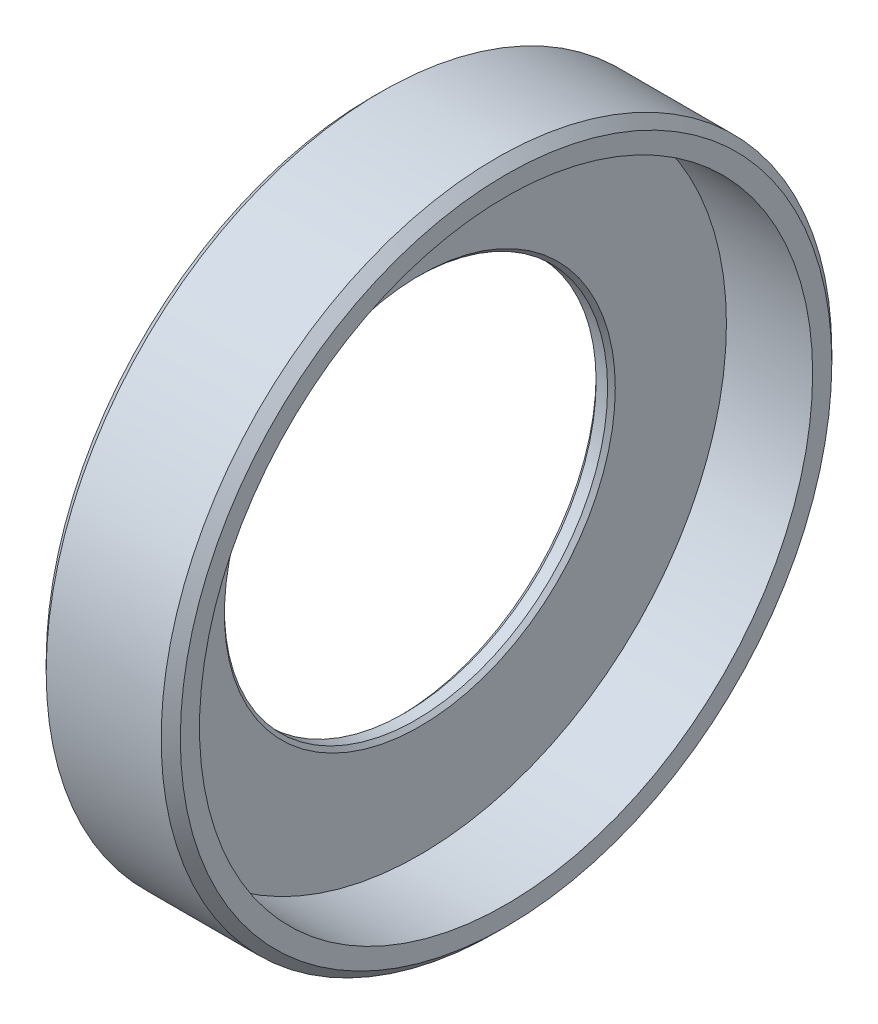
ISO-10303-21;
HEADER;
FILE_DESCRIPTION(('STEP AP214'),'2;1');
FILE_NAME('part.step','',(''),(''),'','','');
FILE_SCHEMA(('AUTOMOTIVE_DESIGN { 1 0 10303 214 1 1 1 1 }'));
ENDSEC;
DATA;
#1=APPLICATION_CONTEXT('core data for automotive mechanical design processes');
#2=APPLICATION_PROTOCOL_DEFINITION('international standard','automotive_design',2000,#1);
#3=PRODUCT_CONTEXT('',#1,'mechanical');
#4=PRODUCT('Part','Part','',(#3));
#5=PRODUCT_RELATED_PRODUCT_CATEGORY('part','',(#4));
#6=PRODUCT_DEFINITION_FORMATION('','',#4);
#7=PRODUCT_DEFINITION_CONTEXT('part definition',#1,'design');
#8=PRODUCT_DEFINITION('design','',#6,#7);
#9=PRODUCT_DEFINITION_SHAPE('','',#8);
#10=(LENGTH_UNIT() NAMED_UNIT(*) SI_UNIT(.MILLI.,.METRE.));
#11=(NAMED_UNIT(*) PLANE_ANGLE_UNIT() SI_UNIT($,.RADIAN.));
#12=(NAMED_UNIT(*) SI_UNIT($,.STERADIAN.) SOLID_ANGLE_UNIT());
#13=UNCERTAINTY_MEASURE_WITH_UNIT(LENGTH_MEASURE(1.E-05),#10,'distance_accuracy_value','');
#14=(GEOMETRIC_REPRESENTATION_CONTEXT(3) GLOBAL_UNCERTAINTY_ASSIGNED_CONTEXT((#13)) GLOBAL_UNIT_ASSIGNED_CONTEXT((#10,
#11,#12)) REPRESENTATION_CONTEXT('',''));
#15=CARTESIAN_POINT('',(0.,0.,0.));
#16=DIRECTION('',(0.,0.,1.));
#17=DIRECTION('',(1.,0.,0.));
#18=AXIS2_PLACEMENT_3D('',#15,#16,#17);
#19=CARTESIAN_POINT('',(0.,0.,0.));
#20=DIRECTION('',(1.,0.,0.));
#21=DIRECTION('',(0.,0.,-1.));
#22=AXIS2_PLACEMENT_3D('',#19,#20,#21);
#23=CYLINDRICAL_SURFACE('',#22,17.5);
#24=CARTESIAN_POINT('',(0.499999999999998,0.,0.));
#25=DIRECTION('',(-1.,0.,0.));
#26=DIRECTION('',(0.,0.,1.));
#27=AXIS2_PLACEMENT_3D('',#24,#25,#26);
#28=CIRCLE('',#27,17.5);
#29=CARTESIAN_POINT('',(0.499999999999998,0.,17.5));
#30=VERTEX_POINT('',#29);
#31=EDGE_CURVE('E68',#30,#30,#28,.F.);
#32=ORIENTED_EDGE('',*,*,#31,.T.);
#33=EDGE_LOOP('',(#32));
#34=FACE_BOUND('',#33,.T.);
#35=CARTESIAN_POINT('',(6.5,0.,0.));
#36=DIRECTION('',(1.,0.,0.));
#37=DIRECTION('',(0.,0.,-1.));
#38=AXIS2_PLACEMENT_3D('',#35,#36,#37);
#39=CIRCLE('',#38,17.5);
#40=CARTESIAN_POINT('',(6.5,0.,-17.5));
#41=VERTEX_POINT('',#40);
#42=EDGE_CURVE('E72',#41,#41,#39,.F.);
#43=ORIENTED_EDGE('',*,*,#42,.T.);
#44=EDGE_LOOP('',(#43));
#45=FACE_BOUND('',#44,.T.);
#46=ADVANCED_FACE('F35',(#34,#45),#23,.T.);
#47=CARTESIAN_POINT('',(0.,0.,-17.5));
#48=DIRECTION('',(-1.,0.,0.));
#49=DIRECTION('',(0.,0.,1.));
#50=AXIS2_PLACEMENT_3D('',#47,#48,#49);
#51=PLANE('',#50);
#52=CARTESIAN_POINT('',(0.,0.,0.));
#53=DIRECTION('',(-1.,0.,0.));
#54=DIRECTION('',(0.,0.,1.));
#55=AXIS2_PLACEMENT_3D('',#52,#53,#54);
#56=CIRCLE('',#55,17.);
#57=CARTESIAN_POINT('',(0.,0.,17.));
#58=VERTEX_POINT('',#57);
#59=EDGE_CURVE('E64',#58,#58,#56,.T.);
#60=ORIENTED_EDGE('',*,*,#59,.T.);
#61=EDGE_LOOP('',(#60));
#62=FACE_BOUND('',#61,.T.);
#63=CARTESIAN_POINT('',(0.,0.,0.));
#64=DIRECTION('',(1.,0.,0.));
#65=DIRECTION('',(0.,0.,-1.));
#66=AXIS2_PLACEMENT_3D('',#63,#64,#65);
#67=CIRCLE('',#66,15.);
#68=CARTESIAN_POINT('',(0.,0.,-15.));
#69=VERTEX_POINT('',#68);
#70=EDGE_CURVE('E76',#69,#69,#67,.T.);
#71=ORIENTED_EDGE('',*,*,#70,.T.);
#72=EDGE_LOOP('',(#71));
#73=FACE_BOUND('',#72,.T.);
#74=ADVANCED_FACE('F106',(#62,#73),#51,.T.);
#75=CARTESIAN_POINT('',(0.,0.,0.));
#76=DIRECTION('',(-1.,0.,0.));
#77=DIRECTION('',(0.,0.,1.));
#78=AXIS2_PLACEMENT_3D('',#75,#76,#77);
#79=CONICAL_SURFACE('',#78,15.,1.27933953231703);
#80=CARTESIAN_POINT('',(1.41428571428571,0.,0.));
#81=DIRECTION('',(1.,0.,0.));
#82=DIRECTION('',(0.,0.,-1.));
#83=AXIS2_PLACEMENT_3D('',#80,#81,#82);
#84=CIRCLE('',#83,10.2857142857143);
#85=CARTESIAN_POINT('',(1.41428571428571,0.,-10.2857142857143));
#86=VERTEX_POINT('',#85);
#87=EDGE_CURVE('E54',#86,#86,#84,.T.);
#88=ORIENTED_EDGE('',*,*,#87,.T.);
#89=EDGE_LOOP('',(#88));
#90=FACE_BOUND('',#89,.T.);
#91=ORIENTED_EDGE('',*,*,#70,.F.);
#92=EDGE_LOOP('',(#91));
#93=FACE_BOUND('',#92,.T.);
#94=ADVANCED_FACE('F112',(#90,#93),#79,.F.);
#95=CARTESIAN_POINT('',(0.,0.,0.));
#96=DIRECTION('',(1.,0.,0.));
#97=DIRECTION('',(0.,0.,-1.));
#98=AXIS2_PLACEMENT_3D('',#95,#96,#97);
#99=CYLINDRICAL_SURFACE('',#98,10.);
#100=CARTESIAN_POINT('',(1.7,0.,0.));
#101=DIRECTION('',(-1.,0.,0.));
#102=DIRECTION('',(0.,0.,1.));
#103=AXIS2_PLACEMENT_3D('',#100,#101,#102);
#104=CIRCLE('',#103,10.);
#105=CARTESIAN_POINT('',(1.7,0.,10.));
#106=VERTEX_POINT('',#105);
#107=EDGE_CURVE('E43',#106,#106,#104,.T.);
#108=ORIENTED_EDGE('',*,*,#107,.T.);
#109=EDGE_LOOP('',(#108));
#110=FACE_BOUND('',#109,.T.);
#111=CARTESIAN_POINT('',(2.30000000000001,0.,0.));
#112=DIRECTION('',(1.,0.,0.));
#113=DIRECTION('',(0.,0.,-1.));
#114=AXIS2_PLACEMENT_3D('',#111,#112,#113);
#115=CIRCLE('',#114,10.);
#116=CARTESIAN_POINT('',(2.30000000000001,0.,-10.));
#117=VERTEX_POINT('',#116);
#118=EDGE_CURVE('E49',#117,#117,#115,.T.);
#119=ORIENTED_EDGE('',*,*,#118,.T.);
#120=EDGE_LOOP('',(#119));
#121=FACE_BOUND('',#120,.T.);
#122=ADVANCED_FACE('F132',(#110,#121),#99,.F.);
#123=CARTESIAN_POINT('',(2.5,0.,-10.));
#124=DIRECTION('',(1.,0.,0.));
#125=DIRECTION('',(0.,0.,-1.));
#126=AXIS2_PLACEMENT_3D('',#123,#124,#125);
#127=PLANE('',#126);
#128=CARTESIAN_POINT('',(2.5,0.,0.));
#129=DIRECTION('',(1.,0.,0.));
#130=DIRECTION('',(0.,0.,-1.));
#131=AXIS2_PLACEMENT_3D('',#128,#129,#130);
#132=CIRCLE('',#131,10.2);
#133=CARTESIAN_POINT('',(2.5,0.,-10.2));
#134=VERTEX_POINT('',#133);
#135=EDGE_CURVE('E10',#134,#134,#132,.F.);
#136=ORIENTED_EDGE('',*,*,#135,.T.);
#137=EDGE_LOOP('',(#136));
#138=FACE_BOUND('',#137,.T.);
#139=CARTESIAN_POINT('',(2.5,0.,0.));
#140=DIRECTION('',(1.,0.,0.));
#141=DIRECTION('',(0.,0.,-1.));
#142=AXIS2_PLACEMENT_3D('',#139,#140,#141);
#143=CIRCLE('',#142,16.);
#144=CARTESIAN_POINT('',(2.5,0.,-16.));
#145=VERTEX_POINT('',#144);
#146=EDGE_CURVE('E80',#145,#145,#143,.T.);
#147=ORIENTED_EDGE('',*,*,#146,.T.);
#148=EDGE_LOOP('',(#147));
#149=FACE_BOUND('',#148,.T.);
#150=ADVANCED_FACE('F103',(#138,#149),#127,.T.);
#151=CARTESIAN_POINT('',(0.,0.,0.));
#152=DIRECTION('',(1.,0.,0.));
#153=DIRECTION('',(0.,0.,-1.));
#154=AXIS2_PLACEMENT_3D('',#151,#152,#153);
#155=CYLINDRICAL_SURFACE('',#154,16.);
#156=CARTESIAN_POINT('',(7.,0.,0.));
#157=DIRECTION('',(1.,0.,0.));
#158=DIRECTION('',(0.,0.,-1.));
#159=AXIS2_PLACEMENT_3D('',#156,#157,#158);
#160=CIRCLE('',#159,16.);
#161=CARTESIAN_POINT('',(7.,0.,-16.));
#162=VERTEX_POINT('',#161);
#163=EDGE_CURVE('E83',#162,#162,#160,.T.);
#164=ORIENTED_EDGE('',*,*,#163,.T.);
#165=EDGE_LOOP('',(#164));
#166=FACE_BOUND('',#165,.T.);
#167=ORIENTED_EDGE('',*,*,#146,.F.);
#168=EDGE_LOOP('',(#167));
#169=FACE_BOUND('',#168,.T.);
#170=ADVANCED_FACE('F88',(#166,#169),#155,.F.);
#171=CARTESIAN_POINT('',(7.,0.,-16.));
#172=DIRECTION('',(1.,0.,0.));
#173=DIRECTION('',(0.,0.,-1.));
#174=AXIS2_PLACEMENT_3D('',#171,#172,#173);
#175=PLANE('',#174);
#176=CARTESIAN_POINT('',(7.,0.,0.));
#177=DIRECTION('',(1.,0.,0.));
#178=DIRECTION('',(0.,0.,-1.));
#179=AXIS2_PLACEMENT_3D('',#176,#177,#178);
#180=CIRCLE('',#179,17.);
#181=CARTESIAN_POINT('',(7.,0.,-17.));
#182=VERTEX_POINT('',#181);
#183=EDGE_CURVE('E60',#182,#182,#180,.T.);
#184=ORIENTED_EDGE('',*,*,#183,.T.);
#185=EDGE_LOOP('',(#184));
#186=FACE_BOUND('',#185,.T.);
#187=ORIENTED_EDGE('',*,*,#163,.F.);
#188=EDGE_LOOP('',(#187));
#189=FACE_BOUND('',#188,.T.);
#190=ADVANCED_FACE('F91',(#186,#189),#175,.T.);
#191=CARTESIAN_POINT('',(0.499999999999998,0.,0.));
#192=DIRECTION('',(1.,0.,0.));
#193=DIRECTION('',(0.,0.,-1.));
#194=AXIS2_PLACEMENT_3D('',#191,#192,#193);
#195=CONICAL_SURFACE('',#194,17.5,0.785398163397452);
#196=ORIENTED_EDGE('',*,*,#59,.F.);
#197=EDGE_LOOP('',(#196));
#198=FACE_BOUND('',#197,.T.);
#199=ORIENTED_EDGE('',*,*,#31,.F.);
#200=EDGE_LOOP('',(#199));
#201=FACE_BOUND('',#200,.T.);
#202=ADVANCED_FACE('F93',(#198,#201),#195,.T.);
#203=CARTESIAN_POINT('',(7.,0.,0.));
#204=DIRECTION('',(-1.,0.,0.));
#205=DIRECTION('',(0.,0.,1.));
#206=AXIS2_PLACEMENT_3D('',#203,#204,#205);
#207=CONICAL_SURFACE('',#206,17.,0.785398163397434);
#208=ORIENTED_EDGE('',*,*,#42,.F.);
#209=EDGE_LOOP('',(#208));
#210=FACE_BOUND('',#209,.T.);
#211=ORIENTED_EDGE('',*,*,#183,.F.);
#212=EDGE_LOOP('',(#211));
#213=FACE_BOUND('',#212,.T.);
#214=ADVANCED_FACE('F100',(#210,#213),#207,.T.);
#215=CARTESIAN_POINT('',(1.41428571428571,0.,0.));
#216=DIRECTION('',(-1.,0.,0.));
#217=DIRECTION('',(0.,0.,1.));
#218=AXIS2_PLACEMENT_3D('',#215,#216,#217);
#219=CONICAL_SURFACE('',#218,10.2857142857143,0.785398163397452);
#220=ORIENTED_EDGE('',*,*,#107,.F.);
#221=EDGE_LOOP('',(#220));
#222=FACE_BOUND('',#221,.T.);
#223=ORIENTED_EDGE('',*,*,#87,.F.);
#224=EDGE_LOOP('',(#223));
#225=FACE_BOUND('',#224,.T.);
#226=ADVANCED_FACE('F119',(#222,#225),#219,.F.);
#227=CARTESIAN_POINT('',(2.30000000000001,0.,0.));
#228=DIRECTION('',(1.,0.,0.));
#229=DIRECTION('',(0.,0.,-1.));
#230=AXIS2_PLACEMENT_3D('',#227,#228,#229);
#231=CONICAL_SURFACE('',#230,10.,0.78539816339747);
#232=ORIENTED_EDGE('',*,*,#135,.F.);
#233=EDGE_LOOP('',(#232));
#234=FACE_BOUND('',#233,.T.);
#235=ORIENTED_EDGE('',*,*,#118,.F.);
#236=EDGE_LOOP('',(#235));
#237=FACE_BOUND('',#236,.T.);
#238=ADVANCED_FACE('F37',(#234,#237),#231,.F.);
#239=CLOSED_SHELL('',(#46,#74,#94,#122,#150,#170,#190,#202,#214,#226,#238));
#240=MANIFOLD_SOLID_BREP('B2',#239);
#241=ADVANCED_BREP_SHAPE_REPRESENTATION('',(#18,#240),#14);
#242=SHAPE_DEFINITION_REPRESENTATION(#9,#241);
ENDSEC;
END-ISO-10303-21;
